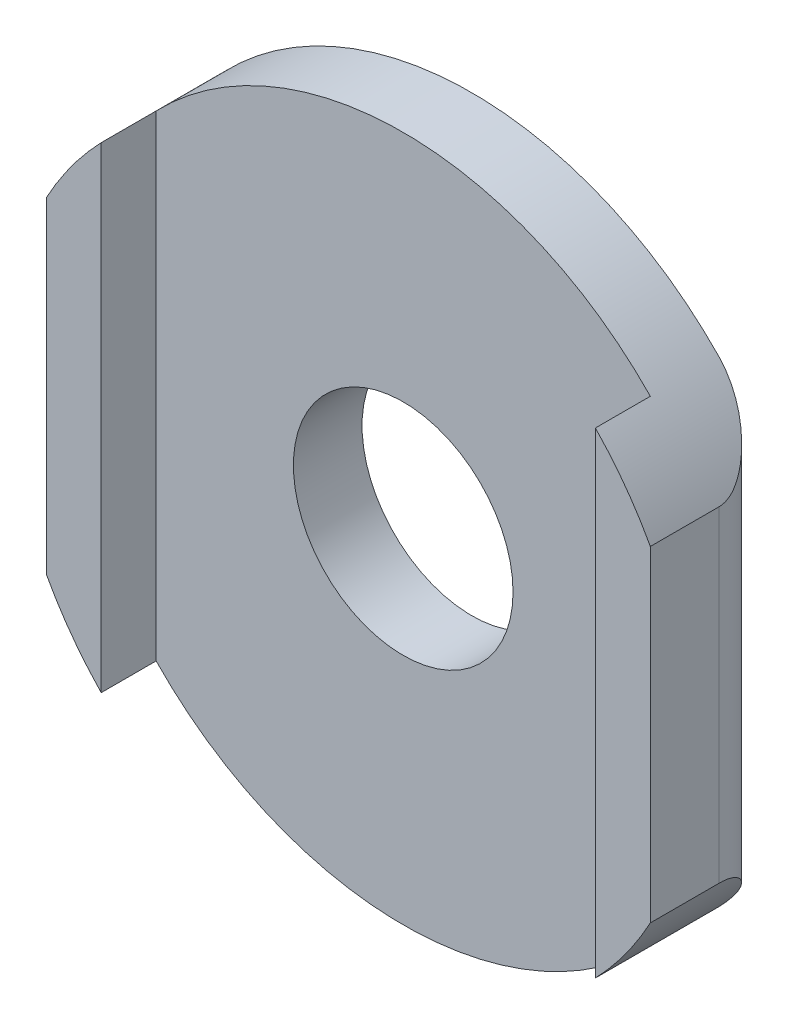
from build123d import *
from build123d.topology import SkipClean

# Parameters (mm, degrees)
SKETCH1_R      = 12.5
EXTRUDE1_DEPTH = 2.5
EXTRUDE2_DEPTH = 2
EXTRUDE3_DEPTH = 18.853571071
SKETCH4_R      = 4
EXTRUDE4_DEPTH = 17.83745824
FILLET1_R      = 2


with BuildPart() as part:
    # Sketch1 → Extrude1 (new body)
    with BuildSketch(Plane.XY):
        Circle(SKETCH1_R)
    extrude(amount=EXTRUDE1_DEPTH)

    # Sketch2 → Extrude2 (add)
    with BuildSketch(Plane.XY.offset(2.5)):
        with BuildLine():
            Line((-11, 5.937171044), (-11, -5.937171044))
            ThreePointArc((-11, -5.937171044), (-10.093239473, -7.37404346), (-9, -8.674675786))
            Line((-9, -8.674675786), (-9, 8.674675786))
            ThreePointArc((-9, 8.674675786), (-10.093239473, 7.37404346), (-11, 5.937171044))
        make_face()
    extrude2 = extrude(amount=EXTRUDE2_DEPTH)

    # Mirror1: Extrude2 across plane
    with SkipClean():  # the faces are left unmerged after this step: merging them gives an invalid solid
        add(extrude2.mirror(Plane(origin=(0, 0, 0), x_dir=(0, 0, 1), z_dir=(1, 0, 0))))

    # Sketch3 → Extrude3 (cut, through all)
    with BuildSketch(Plane.XY.offset(2.5)):
        with BuildLine():
            Line((11, 5.937171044), (11, -5.937171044))
            ThreePointArc((11, -5.937171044), (12.5, 0), (11, 5.937171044))
        make_face()
        with BuildLine():
            Line((-11, -5.937171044), (-11, 5.937171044))
            ThreePointArc((-11, 5.937171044), (-12.5, 0), (-11, -5.937171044))
        make_face()
    extrude(amount=-EXTRUDE3_DEPTH, mode=Mode.SUBTRACT)

    # Sketch4 → Extrude4 (cut, through all)
    with BuildSketch(Plane.XY.offset(2.5)):
        Circle(SKETCH4_R)
    extrude(amount=-EXTRUDE4_DEPTH, mode=Mode.SUBTRACT)

    # Fillet1
    fillet1_edges = [part.edges().sort_by_distance(p)[0] for p in [
        (11, 0, 0),
        (-11, 0, 0),
    ]]
    fillet(fillet1_edges, radius=FILLET1_R)


solid = part.part
